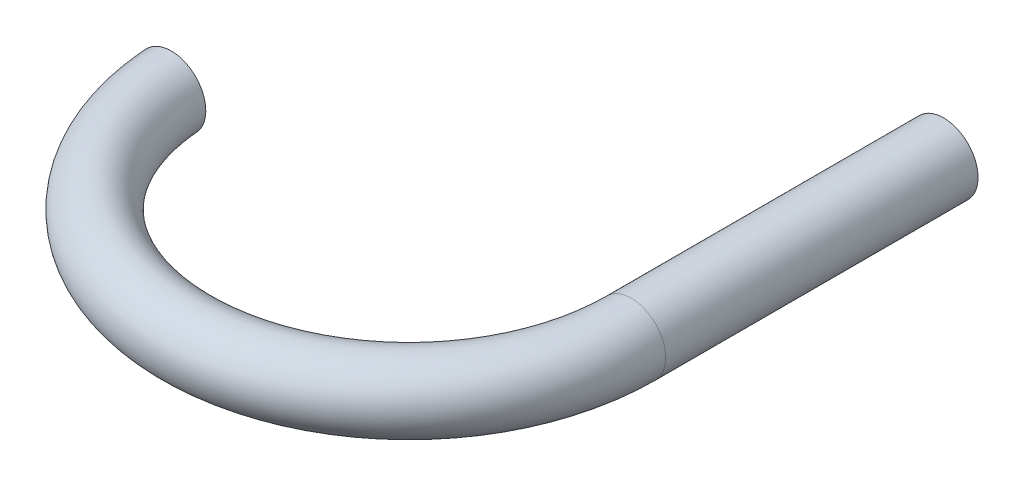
ISO-10303-21;
HEADER;
FILE_DESCRIPTION(('STEP AP214'),'2;1');
FILE_NAME('part.step','',(''),(''),'','','');
FILE_SCHEMA(('AUTOMOTIVE_DESIGN { 1 0 10303 214 1 1 1 1 }'));
ENDSEC;
DATA;
#1=APPLICATION_CONTEXT('core data for automotive mechanical design processes');
#2=APPLICATION_PROTOCOL_DEFINITION('international standard','automotive_design',2000,#1);
#3=PRODUCT_CONTEXT('',#1,'mechanical');
#4=PRODUCT('Part','Part','',(#3));
#5=PRODUCT_RELATED_PRODUCT_CATEGORY('part','',(#4));
#6=PRODUCT_DEFINITION_FORMATION('','',#4);
#7=PRODUCT_DEFINITION_CONTEXT('part definition',#1,'design');
#8=PRODUCT_DEFINITION('design','',#6,#7);
#9=PRODUCT_DEFINITION_SHAPE('','',#8);
#10=(LENGTH_UNIT() NAMED_UNIT(*) SI_UNIT(.MILLI.,.METRE.));
#11=(NAMED_UNIT(*) PLANE_ANGLE_UNIT() SI_UNIT($,.RADIAN.));
#12=(NAMED_UNIT(*) SI_UNIT($,.STERADIAN.) SOLID_ANGLE_UNIT());
#13=UNCERTAINTY_MEASURE_WITH_UNIT(LENGTH_MEASURE(1.E-05),#10,'distance_accuracy_value','');
#14=(GEOMETRIC_REPRESENTATION_CONTEXT(3) GLOBAL_UNCERTAINTY_ASSIGNED_CONTEXT((#13)) GLOBAL_UNIT_ASSIGNED_CONTEXT((#10,
#11,#12)) REPRESENTATION_CONTEXT('',''));
#15=CARTESIAN_POINT('',(0.,0.,0.));
#16=DIRECTION('',(0.,0.,1.));
#17=DIRECTION('',(1.,0.,0.));
#18=AXIS2_PLACEMENT_3D('',#15,#16,#17);
#19=CARTESIAN_POINT('',(0.,0.,0.));
#20=DIRECTION('',(0.,-1.,0.));
#21=DIRECTION('',(0.,0.,-1.));
#22=AXIS2_PLACEMENT_3D('',#19,#20,#21);
#23=TOROIDAL_SURFACE('',#22,210.,32.5);
#24=CARTESIAN_POINT('',(210.,0.,-2.95856190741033E-12));
#25=DIRECTION('',(0.,0.,-1.));
#26=DIRECTION('',(-1.,0.,0.));
#27=AXIS2_PLACEMENT_3D('',#24,#25,#26);
#28=CIRCLE('',#27,32.5);
#29=CARTESIAN_POINT('',(177.5,0.,-2.50068923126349E-12));
#30=VERTEX_POINT('',#29);
#31=EDGE_CURVE('E10',#30,#30,#28,.T.);
#32=ORIENTED_EDGE('',*,*,#31,.F.);
#33=EDGE_LOOP('',(#32));
#34=FACE_BOUND('',#33,.T.);
#35=CARTESIAN_POINT('',(-232.153031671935,-23.3197501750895,15.));
#36=CARTESIAN_POINT('',(-232.808584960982,-22.6847204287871,15.));
#37=CARTESIAN_POINT('',(-233.437312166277,-22.02215820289,15.));
#38=CARTESIAN_POINT('',(-234.637011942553,-20.6462819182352,15.));
#39=CARTESIAN_POINT('',(-235.207969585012,-19.9329548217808,15.));
#40=CARTESIAN_POINT('',(-236.288393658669,-18.459983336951,15.));
#41=CARTESIAN_POINT('',(-236.797792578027,-17.7002894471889,15.));
#42=CARTESIAN_POINT('',(-237.750708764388,-16.1407115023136,15.));
#43=CARTESIAN_POINT('',(-238.194230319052,-15.340830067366,15.));
#44=CARTESIAN_POINT('',(-239.012085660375,-13.7068298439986,15.));
#45=CARTESIAN_POINT('',(-239.386445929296,-12.8727243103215,15.));
#46=CARTESIAN_POINT('',(-240.063506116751,-11.1759029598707,15.));
#47=CARTESIAN_POINT('',(-240.366204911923,-10.313186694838,15.));
#48=CARTESIAN_POINT('',(-240.89769071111,-8.56551662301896,15.));
#49=CARTESIAN_POINT('',(-241.126496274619,-7.68056846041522,15.));
#50=CARTESIAN_POINT('',(-241.50865307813,-5.89453085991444,15.));
#51=CARTESIAN_POINT('',(-241.662004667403,-4.99344149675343,15.));
#52=CARTESIAN_POINT('',(-241.892045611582,-3.18237161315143,15.));
#53=CARTESIAN_POINT('',(-241.968805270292,-2.27240002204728,15.));
#54=CARTESIAN_POINT('',(-242.045357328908,-0.449224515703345,15.));
#55=CARTESIAN_POINT('',(-242.045149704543,0.463979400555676,15.));
#56=CARTESIAN_POINT('',(-241.967767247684,2.28715141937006,15.));
#57=CARTESIAN_POINT('',(-241.890589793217,3.19711941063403,15.));
#58=CARTESIAN_POINT('',(-241.659818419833,5.0073131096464,15.));
#59=CARTESIAN_POINT('',(-241.506224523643,5.90753882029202,15.));
#60=CARTESIAN_POINT('',(-241.1238143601,7.69142271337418,15.));
#61=CARTESIAN_POINT('',(-240.895033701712,8.57508852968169,15.));
#62=CARTESIAN_POINT('',(-240.363871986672,10.3200150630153,15.));
#63=CARTESIAN_POINT('',(-240.061490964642,11.1812757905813,15.));
#64=CARTESIAN_POINT('',(-239.385296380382,12.8752812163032,15.));
#65=CARTESIAN_POINT('',(-239.011482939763,13.7080259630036,15.));
#66=CARTESIAN_POINT('',(-238.195099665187,15.3391012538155,15.));
#67=CARTESIAN_POINT('',(-237.752529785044,16.1374317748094,15.));
#68=CARTESIAN_POINT('',(-236.801491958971,17.6945326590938,15.));
#69=CARTESIAN_POINT('',(-236.292981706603,18.4532771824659,15.));
#70=CARTESIAN_POINT('',(-235.213921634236,19.9252867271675,15.));
#71=CARTESIAN_POINT('',(-234.643371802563,20.638551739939,15.));
#72=CARTESIAN_POINT('',(-233.4443044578,22.0145706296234,15.));
#73=CARTESIAN_POINT('',(-232.815786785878,22.6773243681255,15.));
#74=CARTESIAN_POINT('',(-231.505264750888,23.9476521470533,15.));
#75=CARTESIAN_POINT('',(-230.823260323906,24.5552261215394,15.));
#76=CARTESIAN_POINT('',(-229.40949604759,25.711843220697,15.));
#77=CARTESIAN_POINT('',(-228.677658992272,26.2607919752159,15.));
#78=CARTESIAN_POINT('',(-227.170410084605,27.2951942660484,15.));
#79=CARTESIAN_POINT('',(-226.394998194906,27.7806477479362,15.));
#80=CARTESIAN_POINT('',(-224.806106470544,28.6846612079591,15.));
#81=CARTESIAN_POINT('',(-223.992626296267,29.103220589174,15.));
#82=CARTESIAN_POINT('',(-222.333377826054,29.8705165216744,15.));
#83=CARTESIAN_POINT('',(-221.48760948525,30.2192529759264,15.));
#84=CARTESIAN_POINT('',(-219.76797021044,30.8451317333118,15.));
#85=CARTESIAN_POINT('',(-218.894043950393,31.1221220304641,15.));
#86=CARTESIAN_POINT('',(-217.12599142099,31.6016175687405,15.));
#87=CARTESIAN_POINT('',(-216.231865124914,31.8041227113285,15.));
#88=CARTESIAN_POINT('',(-214.429745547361,32.1332460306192,15.));
#89=CARTESIAN_POINT('',(-213.521752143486,32.2598635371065,15.));
#90=CARTESIAN_POINT('',(-211.698336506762,32.436339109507,15.));
#91=CARTESIAN_POINT('',(-210.782914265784,32.4861970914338,15.));
#92=CARTESIAN_POINT('',(-208.949359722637,32.5088424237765,15.));
#93=CARTESIAN_POINT('',(-208.031225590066,32.4814817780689,15.));
#94=CARTESIAN_POINT('',(-206.200517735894,32.3495789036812,15.));
#95=CARTESIAN_POINT('',(-205.287944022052,32.2450365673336,15.));
#96=CARTESIAN_POINT('',(-203.474826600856,31.9595155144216,15.));
#97=CARTESIAN_POINT('',(-202.574282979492,31.7785362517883,15.));
#98=CARTESIAN_POINT('',(-200.791624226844,31.3414210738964,15.));
#99=CARTESIAN_POINT('',(-199.90950909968,31.085285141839,15.));
#100=CARTESIAN_POINT('',(-198.169224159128,30.4994088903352,15.));
#101=CARTESIAN_POINT('',(-197.31107558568,30.1696054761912,15.));
#102=CARTESIAN_POINT('',(-195.625627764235,29.4388434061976,15.));
#103=CARTESIAN_POINT('',(-194.798328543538,29.0378846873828,15.));
#104=CARTESIAN_POINT('',(-193.180484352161,28.1676362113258,15.));
#105=CARTESIAN_POINT('',(-192.389939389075,27.6983464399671,15.));
#106=CARTESIAN_POINT('',(-190.851260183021,26.6947436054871,15.));
#107=CARTESIAN_POINT('',(-190.103125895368,26.1604306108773,15.));
#108=CARTESIAN_POINT('',(-188.65529623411,25.0310676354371,15.));
#109=CARTESIAN_POINT('',(-187.955557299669,24.4360735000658,15.));
#110=CARTESIAN_POINT('',(-186.608797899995,23.1891434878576,15.));
#111=CARTESIAN_POINT('',(-185.961777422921,22.537207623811,15.));
#112=CARTESIAN_POINT('',(-184.725127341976,21.1810131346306,15.));
#113=CARTESIAN_POINT('',(-184.13549721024,20.4767549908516,15.));
#114=CARTESIAN_POINT('',(-183.017891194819,19.0209079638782,15.));
#115=CARTESIAN_POINT('',(-182.489915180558,18.2693191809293,15.));
#116=CARTESIAN_POINT('',(-181.500773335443,16.7262160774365,15.));
#117=CARTESIAN_POINT('',(-181.039433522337,15.9348132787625,15.));
#118=CARTESIAN_POINT('',(-180.185247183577,14.3158681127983,15.));
#119=CARTESIAN_POINT('',(-179.792400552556,13.4883258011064,15.));
#120=CARTESIAN_POINT('',(-179.07806907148,11.8030080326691,15.));
#121=CARTESIAN_POINT('',(-178.756583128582,10.9452330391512,15.));
#122=CARTESIAN_POINT('',(-178.187316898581,9.20556429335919,15.));
#123=CARTESIAN_POINT('',(-177.939536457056,8.32367059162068,15.));
#124=CARTESIAN_POINT('',(-177.520173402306,6.54494286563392,15.));
#125=CARTESIAN_POINT('',(-177.34834842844,5.64816597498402,15.));
#126=CARTESIAN_POINT('',(-177.080990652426,3.84331135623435,15.));
#127=CARTESIAN_POINT('',(-176.985457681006,2.93523365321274,15.));
#128=CARTESIAN_POINT('',(-176.871383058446,1.11426536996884,15.));
#129=CARTESIAN_POINT('',(-176.852840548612,0.201374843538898,15.));
#130=CARTESIAN_POINT('',(-176.892880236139,-1.62271306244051,15.));
#131=CARTESIAN_POINT('',(-176.951462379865,-2.53391044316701,15.));
#132=CARTESIAN_POINT('',(-177.145142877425,-4.3464298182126,15.));
#133=CARTESIAN_POINT('',(-177.28009951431,-5.24776696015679,15.));
#134=CARTESIAN_POINT('',(-177.625441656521,-7.03587155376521,15.));
#135=CARTESIAN_POINT('',(-177.835827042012,-7.92263902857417,15.));
#136=CARTESIAN_POINT('',(-178.330497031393,-9.67531423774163,15.));
#137=CARTESIAN_POINT('',(-178.614781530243,-10.5412220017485,15.));
#138=CARTESIAN_POINT('',(-179.255188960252,-12.2460513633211,15.));
#139=CARTESIAN_POINT('',(-179.611311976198,-13.0849729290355,15.));
#140=CARTESIAN_POINT('',(-180.393116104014,-14.7305243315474,15.));
#141=CARTESIAN_POINT('',(-180.81884921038,-15.5371294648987,15.));
#142=CARTESIAN_POINT('',(-181.736613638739,-17.111694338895,15.));
#143=CARTESIAN_POINT('',(-182.228644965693,-17.8796540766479,15.));
#144=CARTESIAN_POINT('',(-183.27547769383,-19.3715399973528,15.));
#145=CARTESIAN_POINT('',(-183.830279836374,-20.0954656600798,15.));
#146=CARTESIAN_POINT('',(-184.998680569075,-21.4942021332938,15.));
#147=CARTESIAN_POINT('',(-185.612279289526,-22.169012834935,15.));
#148=CARTESIAN_POINT('',(-186.895714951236,-23.466638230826,15.));
#149=CARTESIAN_POINT('',(-187.565706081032,-24.0893004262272,15.));
#150=CARTESIAN_POINT('',(-188.95563780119,-25.2761259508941,15.));
#151=CARTESIAN_POINT('',(-189.675578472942,-25.8402891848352,15.));
#152=CARTESIAN_POINT('',(-191.160298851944,-26.9061800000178,15.));
#153=CARTESIAN_POINT('',(-191.925079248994,-27.4079066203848,15.));
#154=CARTESIAN_POINT('',(-193.494045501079,-28.3454120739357,15.));
#155=CARTESIAN_POINT('',(-194.298231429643,-28.7811907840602,15.));
#156=CARTESIAN_POINT('',(-195.942897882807,-29.5850203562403,15.));
#157=CARTESIAN_POINT('',(-196.783484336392,-29.9528544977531,15.));
#158=CARTESIAN_POINT('',(-198.492616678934,-30.616520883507,15.));
#159=CARTESIAN_POINT('',(-199.361162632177,-30.9123529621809,15.));
#160=CARTESIAN_POINT('',(-201.120028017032,-31.4299297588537,15.));
#161=CARTESIAN_POINT('',(-202.010346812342,-31.6516766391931,15.));
#162=CARTESIAN_POINT('',(-203.806474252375,-32.0195339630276,15.));
#163=CARTESIAN_POINT('',(-204.712282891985,-32.1656444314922,15.));
#164=CARTESIAN_POINT('',(-206.534501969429,-32.3813753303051,15.));
#165=CARTESIAN_POINT('',(-207.450927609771,-32.4508673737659,15.));
#166=CARTESIAN_POINT('',(-209.286380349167,-32.512421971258,15.));
#167=CARTESIAN_POINT('',(-210.205407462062,-32.5044841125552,15.));
#168=CARTESIAN_POINT('',(-212.039762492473,-32.4112059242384,15.));
#169=CARTESIAN_POINT('',(-212.955089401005,-32.3258457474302,15.));
#170=CARTESIAN_POINT('',(-214.775276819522,-32.0782812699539,15.));
#171=CARTESIAN_POINT('',(-215.680137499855,-31.9160782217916,15.));
#172=CARTESIAN_POINT('',(-217.473275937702,-31.515883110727,15.));
#173=CARTESIAN_POINT('',(-218.361547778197,-31.277864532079,15.));
#174=CARTESIAN_POINT('',(-220.114894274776,-30.7277040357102,15.));
#175=CARTESIAN_POINT('',(-220.979967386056,-30.415557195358,15.));
#176=CARTESIAN_POINT('',(-222.679738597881,-29.7197150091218,15.));
#177=CARTESIAN_POINT('',(-223.514469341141,-29.3360994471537,15.));
#178=CARTESIAN_POINT('',(-225.148322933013,-28.4999472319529,15.));
#179=CARTESIAN_POINT('',(-225.947455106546,-28.0474287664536,15.));
#180=CARTESIAN_POINT('',(-227.702068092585,-26.9534492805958,15.));
#181=CARTESIAN_POINT('',(-228.645885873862,-26.2931619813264,15.));
#182=CARTESIAN_POINT('',(-230.458344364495,-24.8764050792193,15.));
#183=CARTESIAN_POINT('',(-231.326985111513,-24.1199355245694,15.));
#184=CARTESIAN_POINT('',(-232.153031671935,-23.3197501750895,15.));
#185=B_SPLINE_CURVE_WITH_KNOTS('',3,(#35,#36,#37,#38,#39,#40,#41,#42,#43,#44,#45,#46,#47,#48,
#49,#50,#51,#52,#53,#54,#55,#56,#57,#58,#59,#60,#61,#62,#63,#64,#65,#66,#67,#68,#69,#70,#71,#72,
#73,#74,#75,#76,#77,#78,#79,#80,#81,#82,#83,#84,#85,#86,#87,#88,#89,#90,#91,#92,#93,#94,#95,#96,
#97,#98,#99,#100,#101,#102,#103,#104,#105,#106,#107,#108,#109,#110,#111,#112,#113,#114,#115,
#116,#117,#118,#119,#120,#121,#122,#123,#124,#125,#126,#127,#128,#129,#130,#131,#132,#133,#134,
#135,#136,#137,#138,#139,#140,#141,#142,#143,#144,#145,#146,#147,#148,#149,#150,#151,#152,#153,
#154,#155,#156,#157,#158,#159,#160,#161,#162,#163,#164,#165,#166,#167,#168,#169,#170,#171,#172,
#173,#174,#175,#176,#177,#178,#179,#180,#181,#182,#183,#184),.UNSPECIFIED.,.T.,.F.,(4,2,2,2,2,2,
2,2,2,2,2,2,2,2,2,2,2,2,2,2,2,2,2,2,2,2,2,2,2,2,2,2,2,2,2,2,2,2,2,2,2,2,2,2,2,2,2,2,2,2,2,2,2,2,
2,2,2,2,2,2,2,2,2,2,2,2,2,2,2,2,2,2,2,2,4),(0.,2.73708491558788,5.47487533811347,
8.21564157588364,10.9562293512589,13.6957655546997,16.4353447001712,19.1742352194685,
21.9131130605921,24.6494745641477,27.3858369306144,30.1222925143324,32.8587472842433,
35.5939079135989,38.329067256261,41.0642219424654,43.7993784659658,46.5362985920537,
49.2732192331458,52.010147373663,54.7470787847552,57.4883515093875,60.2296265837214,
62.9709261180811,65.7122294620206,68.4592940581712,71.206362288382,73.9534547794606,
76.7005502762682,79.4529143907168,82.2052823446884,84.9576699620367,87.7100581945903,
90.4648128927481,93.2195700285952,95.9743277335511,98.7290825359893,101.481324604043,
104.23356605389,106.985782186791,109.737992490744,112.482881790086,115.227766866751,
117.972609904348,120.71744719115,123.453461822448,126.189470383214,128.925448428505,
131.661424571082,134.39234053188,137.123252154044,139.854159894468,142.585070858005,
145.318031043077,148.050991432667,150.783984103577,153.516982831,156.25771328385,
158.99844820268,161.739225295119,164.480007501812,167.229386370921,169.978771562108,
172.728076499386,175.477380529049,178.231284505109,180.985203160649,183.739827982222,
186.494407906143,189.249952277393,192.005679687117,194.758348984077,197.510292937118,
200.95922798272,204.408161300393),.UNSPECIFIED.);
#186=CARTESIAN_POINT('',(-232.153031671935,-23.3197501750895,15.));
#187=VERTEX_POINT('',#186);
#188=EDGE_CURVE('E18',#187,#187,#185,.T.);
#189=ORIENTED_EDGE('',*,*,#188,.F.);
#190=EDGE_LOOP('',(#189));
#191=FACE_BOUND('',#190,.T.);
#192=ADVANCED_FACE('F14',(#34,#191),#23,.T.);
#193=CARTESIAN_POINT('',(209.999999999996,0.,-295.));
#194=DIRECTION('',(0.,0.,1.));
#195=DIRECTION('',(1.,0.,0.));
#196=AXIS2_PLACEMENT_3D('',#193,#194,#195);
#197=CYLINDRICAL_SURFACE('',#196,32.5);
#198=CARTESIAN_POINT('',(209.999999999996,0.,-295.));
#199=DIRECTION('',(0.,0.,-1.));
#200=DIRECTION('',(-1.,0.,0.));
#201=AXIS2_PLACEMENT_3D('',#198,#199,#200);
#202=CIRCLE('',#201,32.5);
#203=CARTESIAN_POINT('',(177.499999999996,0.,-295.));
#204=VERTEX_POINT('',#203);
#205=EDGE_CURVE('E26',#204,#204,#202,.T.);
#206=ORIENTED_EDGE('',*,*,#205,.F.);
#207=EDGE_LOOP('',(#206));
#208=FACE_BOUND('',#207,.T.);
#209=ORIENTED_EDGE('',*,*,#31,.T.);
#210=EDGE_LOOP('',(#209));
#211=FACE_BOUND('',#210,.T.);
#212=ADVANCED_FACE('F42',(#208,#211),#197,.T.);
#213=CARTESIAN_POINT('',(209.999999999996,0.,-295.));
#214=DIRECTION('',(0.,0.,-1.));
#215=DIRECTION('',(-1.,0.,0.));
#216=AXIS2_PLACEMENT_3D('',#213,#214,#215);
#217=PLANE('',#216);
#218=ORIENTED_EDGE('',*,*,#205,.T.);
#219=EDGE_LOOP('',(#218));
#220=FACE_BOUND('',#219,.T.);
#221=ADVANCED_FACE('F48',(#220),#217,.T.);
#222=CARTESIAN_POINT('',(-298.225813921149,72.1037781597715,15.));
#223=DIRECTION('',(0.,0.,-1.));
#224=DIRECTION('',(-1.,0.,0.));
#225=AXIS2_PLACEMENT_3D('',#222,#223,#224);
#226=PLANE('',#225);
#227=ORIENTED_EDGE('',*,*,#188,.T.);
#228=EDGE_LOOP('',(#227));
#229=FACE_BOUND('',#228,.T.);
#230=ADVANCED_FACE('F39',(#229),#226,.T.);
#231=CLOSED_SHELL('',(#192,#212,#221,#230));
#232=MANIFOLD_SOLID_BREP('B1',#231);
#233=ADVANCED_BREP_SHAPE_REPRESENTATION('',(#18,#232),#14);
#234=SHAPE_DEFINITION_REPRESENTATION(#9,#233);
ENDSEC;
END-ISO-10303-21;
